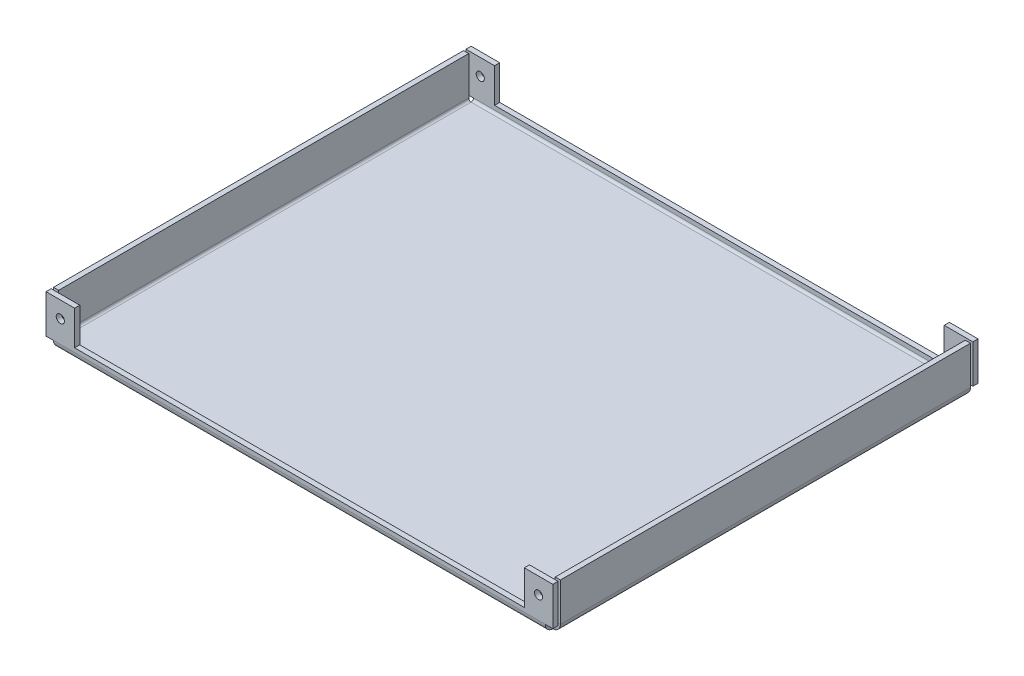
ISO-10303-21;
HEADER;
FILE_DESCRIPTION(('STEP AP214'),'2;1');
FILE_NAME('part.step','',(''),(''),'','','');
FILE_SCHEMA(('AUTOMOTIVE_DESIGN { 1 0 10303 214 1 1 1 1 }'));
ENDSEC;
DATA;
#1=APPLICATION_CONTEXT('core data for automotive mechanical design processes');
#2=APPLICATION_PROTOCOL_DEFINITION('international standard','automotive_design',2000,#1);
#3=PRODUCT_CONTEXT('',#1,'mechanical');
#4=PRODUCT('Part','Part','',(#3));
#5=PRODUCT_RELATED_PRODUCT_CATEGORY('part','',(#4));
#6=PRODUCT_DEFINITION_FORMATION('','',#4);
#7=PRODUCT_DEFINITION_CONTEXT('part definition',#1,'design');
#8=PRODUCT_DEFINITION('design','',#6,#7);
#9=PRODUCT_DEFINITION_SHAPE('','',#8);
#10=(LENGTH_UNIT() NAMED_UNIT(*) SI_UNIT(.MILLI.,.METRE.));
#11=(NAMED_UNIT(*) PLANE_ANGLE_UNIT() SI_UNIT($,.RADIAN.));
#12=(NAMED_UNIT(*) SI_UNIT($,.STERADIAN.) SOLID_ANGLE_UNIT());
#13=UNCERTAINTY_MEASURE_WITH_UNIT(LENGTH_MEASURE(1.E-05),#10,'distance_accuracy_value','');
#14=(GEOMETRIC_REPRESENTATION_CONTEXT(3) GLOBAL_UNCERTAINTY_ASSIGNED_CONTEXT((#13)) GLOBAL_UNIT_ASSIGNED_CONTEXT((#10,
#11,#12)) REPRESENTATION_CONTEXT('',''));
#15=CARTESIAN_POINT('',(0.,0.,0.));
#16=DIRECTION('',(0.,0.,1.));
#17=DIRECTION('',(1.,0.,0.));
#18=AXIS2_PLACEMENT_3D('',#15,#16,#17);
#19=CARTESIAN_POINT('',(76.4032,2.3368,64.4398));
#20=DIRECTION('',(0.,1.,0.));
#21=DIRECTION('',(0.,0.,1.));
#22=AXIS2_PLACEMENT_3D('',#19,#20,#21);
#23=PLANE('',#22);
#24=DIRECTION('',(0.,0.,1.));
#25=VECTOR('',#24,1.);
#26=CARTESIAN_POINT('',(76.4032,2.3368,64.4398));
#27=LINE('',#26,#25);
#28=CARTESIAN_POINT('',(76.4032,2.3368,64.4398));
#29=VERTEX_POINT('',#28);
#30=CARTESIAN_POINT('',(76.4032,2.3368,66.04));
#31=VERTEX_POINT('',#30);
#32=EDGE_CURVE('E13',#29,#31,#27,.T.);
#33=ORIENTED_EDGE('',*,*,#32,.F.);
#34=DIRECTION('',(1.,0.,0.));
#35=VECTOR('',#34,1.);
#36=CARTESIAN_POINT('',(-78.74,2.3368,64.4398));
#37=LINE('',#36,#35);
#38=CARTESIAN_POINT('',(78.74,2.3368,64.4398));
#39=VERTEX_POINT('',#38);
#40=EDGE_CURVE('E630',#29,#39,#37,.T.);
#41=ORIENTED_EDGE('',*,*,#40,.T.);
#42=DIRECTION('',(0.,0.,-1.));
#43=VECTOR('',#42,1.);
#44=CARTESIAN_POINT('',(78.74,2.3368,64.4398));
#45=LINE('',#44,#43);
#46=CARTESIAN_POINT('',(78.74,2.3368,66.04));
#47=VERTEX_POINT('',#46);
#48=EDGE_CURVE('E657',#39,#47,#45,.F.);
#49=ORIENTED_EDGE('',*,*,#48,.T.);
#50=DIRECTION('',(1.,0.,0.));
#51=VECTOR('',#50,1.);
#52=CARTESIAN_POINT('',(-78.74,2.3368,66.04));
#53=LINE('',#52,#51);
#54=EDGE_CURVE('E632',#47,#31,#53,.F.);
#55=ORIENTED_EDGE('',*,*,#54,.T.);
#56=EDGE_LOOP('',(#33,#41,#49,#55));
#57=FACE_BOUND('',#56,.T.);
#58=ADVANCED_FACE('F125',(#57),#23,.F.);
#59=CARTESIAN_POINT('',(78.74,2.3368,63.7032));
#60=DIRECTION('',(1.,0.,0.));
#61=DIRECTION('',(0.,0.,1.));
#62=AXIS2_PLACEMENT_3D('',#59,#60,#61);
#63=CYLINDRICAL_SURFACE('',#62,2.3368);
#64=DIRECTION('',(1.,0.,0.));
#65=VECTOR('',#64,1.);
#66=CARTESIAN_POINT('',(78.74,0.,63.7032));
#67=LINE('',#66,#65);
#68=CARTESIAN_POINT('',(76.4032,0.,63.7032));
#69=VERTEX_POINT('',#68);
#70=CARTESIAN_POINT('',(-76.4032,0.,63.7032));
#71=VERTEX_POINT('',#70);
#72=EDGE_CURVE('E663',#69,#71,#67,.F.);
#73=ORIENTED_EDGE('',*,*,#72,.F.);
#74=CARTESIAN_POINT('',(76.4032,2.3368,63.7032));
#75=DIRECTION('',(1.,0.,0.));
#76=DIRECTION('',(0.,0.,-1.));
#77=AXIS2_PLACEMENT_3D('',#74,#75,#76);
#78=CIRCLE('',#77,2.3368);
#79=EDGE_CURVE('E133',#69,#31,#78,.F.);
#80=ORIENTED_EDGE('',*,*,#79,.T.);
#81=CARTESIAN_POINT('',(-76.4032,2.3368,66.04));
#82=VERTEX_POINT('',#81);
#83=EDGE_CURVE('E689',#31,#82,#53,.F.);
#84=ORIENTED_EDGE('',*,*,#83,.T.);
#85=CARTESIAN_POINT('',(-76.4032,2.3368,63.7032));
#86=DIRECTION('',(-1.,0.,0.));
#87=DIRECTION('',(0.,0.,1.));
#88=AXIS2_PLACEMENT_3D('',#85,#86,#87);
#89=CIRCLE('',#88,2.3368);
#90=EDGE_CURVE('E675',#82,#71,#89,.F.);
#91=ORIENTED_EDGE('',*,*,#90,.T.);
#92=EDGE_LOOP('',(#73,#80,#84,#91));
#93=FACE_BOUND('',#92,.T.);
#94=ADVANCED_FACE('F619',(#93),#63,.T.);
#95=CARTESIAN_POINT('',(76.4032,2.3368,63.7032));
#96=DIRECTION('',(1.,0.,0.));
#97=DIRECTION('',(0.,0.,-1.));
#98=AXIS2_PLACEMENT_3D('',#95,#96,#97);
#99=PLANE('',#98);
#100=CARTESIAN_POINT('',(76.4032,2.3368,63.7032));
#101=DIRECTION('',(1.,0.,0.));
#102=DIRECTION('',(0.,0.,-1.));
#103=AXIS2_PLACEMENT_3D('',#100,#101,#102);
#104=CIRCLE('',#103,0.736600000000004);
#105=CARTESIAN_POINT('',(76.4032,1.6002,63.7032));
#106=VERTEX_POINT('',#105);
#107=EDGE_CURVE('E636',#106,#29,#104,.F.);
#108=ORIENTED_EDGE('',*,*,#107,.T.);
#109=ORIENTED_EDGE('',*,*,#32,.T.);
#110=ORIENTED_EDGE('',*,*,#79,.F.);
#111=DIRECTION('',(0.,-1.,0.));
#112=VECTOR('',#111,1.);
#113=CARTESIAN_POINT('',(76.4032,1.6002,63.7032));
#114=LINE('',#113,#112);
#115=EDGE_CURVE('E485',#106,#69,#114,.T.);
#116=ORIENTED_EDGE('',*,*,#115,.F.);
#117=EDGE_LOOP('',(#108,#109,#110,#116));
#118=FACE_BOUND('',#117,.T.);
#119=ADVANCED_FACE('F624',(#118),#99,.T.);
#120=CARTESIAN_POINT('',(76.4032,2.33680000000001,-66.04));
#121=DIRECTION('',(0.,-1.,0.));
#122=DIRECTION('',(0.,0.,-1.));
#123=AXIS2_PLACEMENT_3D('',#120,#121,#122);
#124=PLANE('',#123);
#125=DIRECTION('',(0.,0.,1.));
#126=VECTOR('',#125,1.);
#127=CARTESIAN_POINT('',(76.4032,2.33680000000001,-66.04));
#128=LINE('',#127,#126);
#129=CARTESIAN_POINT('',(76.4032,2.33680000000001,-66.04));
#130=VERTEX_POINT('',#129);
#131=CARTESIAN_POINT('',(76.4032,2.3368,-64.4398));
#132=VERTEX_POINT('',#131);
#133=EDGE_CURVE('E640',#130,#132,#128,.T.);
#134=ORIENTED_EDGE('',*,*,#133,.F.);
#135=DIRECTION('',(-1.,0.,0.));
#136=VECTOR('',#135,1.);
#137=CARTESIAN_POINT('',(78.74,2.33680000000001,-66.04));
#138=LINE('',#137,#136);
#139=CARTESIAN_POINT('',(78.74,2.33679999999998,-66.04));
#140=VERTEX_POINT('',#139);
#141=EDGE_CURVE('E414',#130,#140,#138,.F.);
#142=ORIENTED_EDGE('',*,*,#141,.T.);
#143=DIRECTION('',(0.,0.,1.));
#144=VECTOR('',#143,1.);
#145=CARTESIAN_POINT('',(78.74,2.33680000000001,-66.04));
#146=LINE('',#145,#144);
#147=CARTESIAN_POINT('',(78.74,2.33679999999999,-64.4398));
#148=VERTEX_POINT('',#147);
#149=EDGE_CURVE('E421',#148,#140,#146,.F.);
#150=ORIENTED_EDGE('',*,*,#149,.F.);
#151=DIRECTION('',(-1.,0.,0.));
#152=VECTOR('',#151,1.);
#153=CARTESIAN_POINT('',(78.74,2.3368,-64.4398));
#154=LINE('',#153,#152);
#155=EDGE_CURVE('E416',#148,#132,#154,.T.);
#156=ORIENTED_EDGE('',*,*,#155,.T.);
#157=EDGE_LOOP('',(#134,#142,#150,#156));
#158=FACE_BOUND('',#157,.T.);
#159=ADVANCED_FACE('F794',(#158),#124,.T.);
#160=CARTESIAN_POINT('',(-78.74,2.33679999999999,-63.7032));
#161=DIRECTION('',(-1.,0.,0.));
#162=DIRECTION('',(0.,0.,-1.));
#163=AXIS2_PLACEMENT_3D('',#160,#161,#162);
#164=CYLINDRICAL_SURFACE('',#163,2.33680000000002);
#165=CARTESIAN_POINT('',(-76.4032,2.33680000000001,-66.04));
#166=VERTEX_POINT('',#165);
#167=EDGE_CURVE('E413',#166,#130,#138,.F.);
#168=ORIENTED_EDGE('',*,*,#167,.T.);
#169=CARTESIAN_POINT('',(76.4032,2.33679999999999,-63.7032));
#170=DIRECTION('',(1.,0.,0.));
#171=DIRECTION('',(0.,0.,-1.));
#172=AXIS2_PLACEMENT_3D('',#169,#170,#171);
#173=CIRCLE('',#172,2.33680000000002);
#174=CARTESIAN_POINT('',(76.4032,0.,-63.7032));
#175=VERTEX_POINT('',#174);
#176=EDGE_CURVE('E681',#130,#175,#173,.F.);
#177=ORIENTED_EDGE('',*,*,#176,.T.);
#178=DIRECTION('',(-1.,0.,0.));
#179=VECTOR('',#178,1.);
#180=CARTESIAN_POINT('',(-78.74,0.,-63.7032));
#181=LINE('',#180,#179);
#182=CARTESIAN_POINT('',(-76.4032,0.,-63.7032));
#183=VERTEX_POINT('',#182);
#184=EDGE_CURVE('E425',#183,#175,#181,.F.);
#185=ORIENTED_EDGE('',*,*,#184,.F.);
#186=CARTESIAN_POINT('',(-76.4032,2.33679999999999,-63.7032));
#187=DIRECTION('',(-1.,0.,0.));
#188=DIRECTION('',(0.,0.,1.));
#189=AXIS2_PLACEMENT_3D('',#186,#187,#188);
#190=CIRCLE('',#189,2.33680000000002);
#191=EDGE_CURVE('E670',#183,#166,#190,.F.);
#192=ORIENTED_EDGE('',*,*,#191,.T.);
#193=EDGE_LOOP('',(#168,#177,#185,#192));
#194=FACE_BOUND('',#193,.T.);
#195=ADVANCED_FACE('F790',(#194),#164,.T.);
#196=CARTESIAN_POINT('',(78.74,1.6002,-66.04));
#197=DIRECTION('',(0.,1.,0.));
#198=DIRECTION('',(0.,0.,1.));
#199=AXIS2_PLACEMENT_3D('',#196,#197,#198);
#200=PLANE('',#199);
#201=DIRECTION('',(1.,0.,0.));
#202=VECTOR('',#201,1.);
#203=CARTESIAN_POINT('',(78.74,1.6002,63.7032));
#204=LINE('',#203,#202);
#205=CARTESIAN_POINT('',(-76.4032,1.6002,63.7032));
#206=VERTEX_POINT('',#205);
#207=EDGE_CURVE('E438',#106,#206,#204,.F.);
#208=ORIENTED_EDGE('',*,*,#207,.F.);
#209=DIRECTION('',(0.,0.,-1.));
#210=VECTOR('',#209,1.);
#211=CARTESIAN_POINT('',(76.4032,1.6002,-63.7032));
#212=LINE('',#211,#210);
#213=CARTESIAN_POINT('',(76.4032,1.6002,-63.7032));
#214=VERTEX_POINT('',#213);
#215=EDGE_CURVE('E520',#214,#106,#212,.F.);
#216=ORIENTED_EDGE('',*,*,#215,.F.);
#217=DIRECTION('',(-1.,0.,0.));
#218=VECTOR('',#217,1.);
#219=CARTESIAN_POINT('',(-78.74,1.60019999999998,-63.7032));
#220=LINE('',#219,#218);
#221=CARTESIAN_POINT('',(-76.4032,1.60019999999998,-63.7032));
#222=VERTEX_POINT('',#221);
#223=EDGE_CURVE('E428',#222,#214,#220,.F.);
#224=ORIENTED_EDGE('',*,*,#223,.F.);
#225=DIRECTION('',(0.,0.,1.));
#226=VECTOR('',#225,1.);
#227=CARTESIAN_POINT('',(-76.4032,1.6002,63.7032));
#228=LINE('',#227,#226);
#229=EDGE_CURVE('E466',#206,#222,#228,.F.);
#230=ORIENTED_EDGE('',*,*,#229,.F.);
#231=EDGE_LOOP('',(#208,#216,#224,#230));
#232=FACE_BOUND('',#231,.T.);
#233=ADVANCED_FACE('F793',(#232),#200,.T.);
#234=CARTESIAN_POINT('',(78.74,0.,-66.04));
#235=DIRECTION('',(0.,1.,0.));
#236=DIRECTION('',(0.,0.,1.));
#237=AXIS2_PLACEMENT_3D('',#234,#235,#236);
#238=PLANE('',#237);
#239=DIRECTION('',(0.,0.,-1.));
#240=VECTOR('',#239,1.);
#241=CARTESIAN_POINT('',(76.4032,0.,-63.7032));
#242=LINE('',#241,#240);
#243=EDGE_CURVE('E530',#175,#69,#242,.F.);
#244=ORIENTED_EDGE('',*,*,#243,.T.);
#245=ORIENTED_EDGE('',*,*,#72,.T.);
#246=DIRECTION('',(0.,0.,1.));
#247=VECTOR('',#246,1.);
#248=CARTESIAN_POINT('',(-76.4032,0.,63.7032));
#249=LINE('',#248,#247);
#250=EDGE_CURVE('E476',#71,#183,#249,.F.);
#251=ORIENTED_EDGE('',*,*,#250,.T.);
#252=ORIENTED_EDGE('',*,*,#184,.T.);
#253=EDGE_LOOP('',(#244,#245,#251,#252));
#254=FACE_BOUND('',#253,.T.);
#255=ADVANCED_FACE('F716',(#254),#238,.F.);
#256=CARTESIAN_POINT('',(-76.4032,2.3368,66.04));
#257=DIRECTION('',(0.,-1.,0.));
#258=DIRECTION('',(0.,0.,-1.));
#259=AXIS2_PLACEMENT_3D('',#256,#257,#258);
#260=PLANE('',#259);
#261=DIRECTION('',(0.,0.,-1.));
#262=VECTOR('',#261,1.);
#263=CARTESIAN_POINT('',(-76.4032,2.3368,66.04));
#264=LINE('',#263,#262);
#265=CARTESIAN_POINT('',(-76.4032,2.3368,64.4398));
#266=VERTEX_POINT('',#265);
#267=EDGE_CURVE('E679',#82,#266,#264,.T.);
#268=ORIENTED_EDGE('',*,*,#267,.F.);
#269=CARTESIAN_POINT('',(-78.74,2.3368,66.04));
#270=VERTEX_POINT('',#269);
#271=EDGE_CURVE('E693',#82,#270,#53,.F.);
#272=ORIENTED_EDGE('',*,*,#271,.T.);
#273=DIRECTION('',(0.,0.,-1.));
#274=VECTOR('',#273,1.);
#275=CARTESIAN_POINT('',(-78.74,2.3368,66.04));
#276=LINE('',#275,#274);
#277=CARTESIAN_POINT('',(-78.74,2.3368,64.4398));
#278=VERTEX_POINT('',#277);
#279=EDGE_CURVE('E427',#278,#270,#276,.F.);
#280=ORIENTED_EDGE('',*,*,#279,.F.);
#281=EDGE_CURVE('E652',#278,#266,#37,.T.);
#282=ORIENTED_EDGE('',*,*,#281,.T.);
#283=EDGE_LOOP('',(#268,#272,#280,#282));
#284=FACE_BOUND('',#283,.T.);
#285=ADVANCED_FACE('F709',(#284),#260,.T.);
#286=CARTESIAN_POINT('',(-76.4032,2.3368,-64.4398));
#287=DIRECTION('',(0.,1.,0.));
#288=DIRECTION('',(0.,0.,1.));
#289=AXIS2_PLACEMENT_3D('',#286,#287,#288);
#290=PLANE('',#289);
#291=DIRECTION('',(0.,0.,-1.));
#292=VECTOR('',#291,1.);
#293=CARTESIAN_POINT('',(-76.4032,2.3368,-64.4398));
#294=LINE('',#293,#292);
#295=CARTESIAN_POINT('',(-76.4032,2.3368,-64.4398));
#296=VERTEX_POINT('',#295);
#297=EDGE_CURVE('E673',#296,#166,#294,.T.);
#298=ORIENTED_EDGE('',*,*,#297,.F.);
#299=CARTESIAN_POINT('',(-78.74,2.33679999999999,-64.4398));
#300=VERTEX_POINT('',#299);
#301=EDGE_CURVE('E420',#296,#300,#154,.T.);
#302=ORIENTED_EDGE('',*,*,#301,.T.);
#303=DIRECTION('',(0.,0.,1.));
#304=VECTOR('',#303,1.);
#305=CARTESIAN_POINT('',(-78.74,2.3368,-64.4398));
#306=LINE('',#305,#304);
#307=CARTESIAN_POINT('',(-78.74,2.33680000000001,-66.04));
#308=VERTEX_POINT('',#307);
#309=EDGE_CURVE('E342',#300,#308,#306,.F.);
#310=ORIENTED_EDGE('',*,*,#309,.T.);
#311=EDGE_CURVE('E410',#308,#166,#138,.F.);
#312=ORIENTED_EDGE('',*,*,#311,.T.);
#313=EDGE_LOOP('',(#298,#302,#310,#312));
#314=FACE_BOUND('',#313,.T.);
#315=ADVANCED_FACE('F825',(#314),#290,.F.);
#316=CARTESIAN_POINT('',(76.4032,2.33679999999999,-63.7032));
#317=DIRECTION('',(1.,0.,0.));
#318=DIRECTION('',(0.,0.,-1.));
#319=AXIS2_PLACEMENT_3D('',#316,#317,#318);
#320=PLANE('',#319);
#321=ORIENTED_EDGE('',*,*,#176,.F.);
#322=ORIENTED_EDGE('',*,*,#133,.T.);
#323=CARTESIAN_POINT('',(76.4032,2.33679999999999,-63.7032));
#324=DIRECTION('',(1.,0.,0.));
#325=DIRECTION('',(0.,0.,-1.));
#326=AXIS2_PLACEMENT_3D('',#323,#324,#325);
#327=CIRCLE('',#326,0.736600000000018);
#328=EDGE_CURVE('E684',#132,#214,#327,.F.);
#329=ORIENTED_EDGE('',*,*,#328,.T.);
#330=DIRECTION('',(0.,-1.,0.));
#331=VECTOR('',#330,1.);
#332=CARTESIAN_POINT('',(76.4032,1.6002,-63.7032));
#333=LINE('',#332,#331);
#334=EDGE_CURVE('E511',#214,#175,#333,.T.);
#335=ORIENTED_EDGE('',*,*,#334,.T.);
#336=EDGE_LOOP('',(#321,#322,#329,#335));
#337=FACE_BOUND('',#336,.T.);
#338=ADVANCED_FACE('F823',(#337),#320,.T.);
#339=CARTESIAN_POINT('',(-76.4032,2.33679999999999,-63.7032));
#340=DIRECTION('',(-1.,0.,0.));
#341=DIRECTION('',(0.,0.,1.));
#342=AXIS2_PLACEMENT_3D('',#339,#340,#341);
#343=PLANE('',#342);
#344=CARTESIAN_POINT('',(-76.4032,2.33679999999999,-63.7032));
#345=DIRECTION('',(-1.,0.,0.));
#346=DIRECTION('',(0.,0.,1.));
#347=AXIS2_PLACEMENT_3D('',#344,#345,#346);
#348=CIRCLE('',#347,0.736600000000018);
#349=EDGE_CURVE('E666',#222,#296,#348,.F.);
#350=ORIENTED_EDGE('',*,*,#349,.T.);
#351=ORIENTED_EDGE('',*,*,#297,.T.);
#352=ORIENTED_EDGE('',*,*,#191,.F.);
#353=DIRECTION('',(0.,-1.,0.));
#354=VECTOR('',#353,1.);
#355=CARTESIAN_POINT('',(-76.4032,1.6002,-63.7032));
#356=LINE('',#355,#354);
#357=EDGE_CURVE('E424',#222,#183,#356,.T.);
#358=ORIENTED_EDGE('',*,*,#357,.F.);
#359=EDGE_LOOP('',(#350,#351,#352,#358));
#360=FACE_BOUND('',#359,.T.);
#361=ADVANCED_FACE('F820',(#360),#343,.T.);
#362=CARTESIAN_POINT('',(-76.4032,2.3368,63.7032));
#363=DIRECTION('',(-1.,0.,0.));
#364=DIRECTION('',(0.,0.,1.));
#365=AXIS2_PLACEMENT_3D('',#362,#363,#364);
#366=PLANE('',#365);
#367=ORIENTED_EDGE('',*,*,#90,.F.);
#368=ORIENTED_EDGE('',*,*,#267,.T.);
#369=CARTESIAN_POINT('',(-76.4032,2.3368,63.7032));
#370=DIRECTION('',(-1.,0.,0.));
#371=DIRECTION('',(0.,0.,1.));
#372=AXIS2_PLACEMENT_3D('',#369,#370,#371);
#373=CIRCLE('',#372,0.736600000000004);
#374=EDGE_CURVE('E656',#266,#206,#373,.F.);
#375=ORIENTED_EDGE('',*,*,#374,.T.);
#376=DIRECTION('',(0.,-1.,0.));
#377=VECTOR('',#376,1.);
#378=CARTESIAN_POINT('',(-76.4032,1.6002,63.7032));
#379=LINE('',#378,#377);
#380=EDGE_CURVE('E458',#206,#71,#379,.T.);
#381=ORIENTED_EDGE('',*,*,#380,.T.);
#382=EDGE_LOOP('',(#367,#368,#375,#381));
#383=FACE_BOUND('',#382,.T.);
#384=ADVANCED_FACE('F712',(#383),#366,.T.);
#385=CARTESIAN_POINT('',(78.74,2.3368,63.7032));
#386=DIRECTION('',(1.,0.,0.));
#387=DIRECTION('',(0.,0.,1.));
#388=AXIS2_PLACEMENT_3D('',#385,#386,#387);
#389=CYLINDRICAL_SURFACE('',#388,0.736600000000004);
#390=ORIENTED_EDGE('',*,*,#107,.F.);
#391=ORIENTED_EDGE('',*,*,#207,.T.);
#392=ORIENTED_EDGE('',*,*,#374,.F.);
#393=EDGE_CURVE('E647',#266,#29,#37,.T.);
#394=ORIENTED_EDGE('',*,*,#393,.T.);
#395=EDGE_LOOP('',(#390,#391,#392,#394));
#396=FACE_BOUND('',#395,.T.);
#397=ADVANCED_FACE('F654',(#396),#389,.F.);
#398=CARTESIAN_POINT('',(-78.74,1.6002,66.04));
#399=DIRECTION('',(1.,0.,0.));
#400=DIRECTION('',(0.,0.,-1.));
#401=AXIS2_PLACEMENT_3D('',#398,#399,#400);
#402=PLANE('',#401);
#403=ORIENTED_EDGE('',*,*,#279,.T.);
#404=DIRECTION('',(0.,-1.,0.));
#405=VECTOR('',#404,1.);
#406=CARTESIAN_POINT('',(-78.74,3.6322,66.04));
#407=LINE('',#406,#405);
#408=CARTESIAN_POINT('',(-78.74,14.3002,66.04));
#409=VERTEX_POINT('',#408);
#410=EDGE_CURVE('E699',#409,#270,#407,.T.);
#411=ORIENTED_EDGE('',*,*,#410,.F.);
#412=DIRECTION('',(0.,0.,1.));
#413=VECTOR('',#412,1.);
#414=CARTESIAN_POINT('',(-78.74,14.3002,64.4398));
#415=LINE('',#414,#413);
#416=CARTESIAN_POINT('',(-78.74,14.3002,64.4398));
#417=VERTEX_POINT('',#416);
#418=EDGE_CURVE('E539',#417,#409,#415,.T.);
#419=ORIENTED_EDGE('',*,*,#418,.F.);
#420=DIRECTION('',(0.,1.,0.));
#421=VECTOR('',#420,1.);
#422=CARTESIAN_POINT('',(-78.74,1.6002,64.4398));
#423=LINE('',#422,#421);
#424=EDGE_CURVE('E694',#417,#278,#423,.F.);
#425=ORIENTED_EDGE('',*,*,#424,.T.);
#426=EDGE_LOOP('',(#403,#411,#419,#425));
#427=FACE_BOUND('',#426,.T.);
#428=ADVANCED_FACE('F707',(#427),#402,.F.);
#429=CARTESIAN_POINT('',(78.74,3.6322,66.04));
#430=DIRECTION('',(-1.,0.,0.));
#431=DIRECTION('',(0.,0.,1.));
#432=AXIS2_PLACEMENT_3D('',#429,#430,#431);
#433=PLANE('',#432);
#434=ORIENTED_EDGE('',*,*,#48,.F.);
#435=DIRECTION('',(0.,-1.,0.));
#436=VECTOR('',#435,1.);
#437=CARTESIAN_POINT('',(78.74,3.6322,64.4398));
#438=LINE('',#437,#436);
#439=CARTESIAN_POINT('',(78.74,14.3002,64.4398));
#440=VERTEX_POINT('',#439);
#441=EDGE_CURVE('E650',#39,#440,#438,.F.);
#442=ORIENTED_EDGE('',*,*,#441,.T.);
#443=DIRECTION('',(0.,0.,1.));
#444=VECTOR('',#443,1.);
#445=CARTESIAN_POINT('',(78.74,14.3002,64.4398));
#446=LINE('',#445,#444);
#447=CARTESIAN_POINT('',(78.74,14.3002,66.04));
#448=VERTEX_POINT('',#447);
#449=EDGE_CURVE('E1419',#440,#448,#446,.T.);
#450=ORIENTED_EDGE('',*,*,#449,.T.);
#451=DIRECTION('',(0.,1.,0.));
#452=VECTOR('',#451,1.);
#453=CARTESIAN_POINT('',(78.74,3.6322,66.04));
#454=LINE('',#453,#452);
#455=EDGE_CURVE('E433',#47,#448,#454,.T.);
#456=ORIENTED_EDGE('',*,*,#455,.F.);
#457=EDGE_LOOP('',(#434,#442,#450,#456));
#458=FACE_BOUND('',#457,.T.);
#459=ADVANCED_FACE('F801',(#458),#433,.F.);
#460=CARTESIAN_POINT('',(-78.74,3.6322,66.04));
#461=DIRECTION('',(0.,0.,-1.));
#462=DIRECTION('',(-1.,0.,0.));
#463=AXIS2_PLACEMENT_3D('',#460,#461,#462);
#464=PLANE('',#463);
#465=CARTESIAN_POINT('',(-74.295,9.22019999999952,66.04));
#466=DIRECTION('',(0.,0.,-1.));
#467=DIRECTION('',(-1.,0.,0.));
#468=AXIS2_PLACEMENT_3D('',#465,#466,#467);
#469=CIRCLE('',#468,1.26999999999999);
#470=CARTESIAN_POINT('',(-75.565,9.22019999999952,66.04));
#471=VERTEX_POINT('',#470);
#472=EDGE_CURVE('E1248',#471,#471,#469,.T.);
#473=ORIENTED_EDGE('',*,*,#472,.T.);
#474=EDGE_LOOP('',(#473));
#475=FACE_BOUND('',#474,.T.);
#476=CARTESIAN_POINT('',(74.2950000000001,9.22019999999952,66.04));
#477=DIRECTION('',(0.,0.,-1.));
#478=DIRECTION('',(-1.,0.,0.));
#479=AXIS2_PLACEMENT_3D('',#476,#477,#478);
#480=CIRCLE('',#479,1.26999999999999);
#481=CARTESIAN_POINT('',(73.0250000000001,9.22019999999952,66.04));
#482=VERTEX_POINT('',#481);
#483=EDGE_CURVE('E364',#482,#482,#480,.T.);
#484=ORIENTED_EDGE('',*,*,#483,.T.);
#485=EDGE_LOOP('',(#484));
#486=FACE_BOUND('',#485,.T.);
#487=ORIENTED_EDGE('',*,*,#54,.F.);
#488=ORIENTED_EDGE('',*,*,#455,.T.);
#489=DIRECTION('',(-1.,0.,0.));
#490=VECTOR('',#489,1.);
#491=CARTESIAN_POINT('',(78.74,14.3002,66.04));
#492=LINE('',#491,#490);
#493=CARTESIAN_POINT('',(69.85,14.3002,66.04));
#494=VERTEX_POINT('',#493);
#495=EDGE_CURVE('E383',#448,#494,#492,.T.);
#496=ORIENTED_EDGE('',*,*,#495,.T.);
#497=DIRECTION('',(0.,-1.,0.));
#498=VECTOR('',#497,1.);
#499=CARTESIAN_POINT('',(69.85,3.6322,66.04));
#500=LINE('',#499,#498);
#501=CARTESIAN_POINT('',(69.8500000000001,3.6322,66.04));
#502=VERTEX_POINT('',#501);
#503=EDGE_CURVE('E1422',#494,#502,#500,.T.);
#504=ORIENTED_EDGE('',*,*,#503,.T.);
#505=DIRECTION('',(-1.,0.,0.));
#506=VECTOR('',#505,1.);
#507=CARTESIAN_POINT('',(-78.74,3.6322,66.04));
#508=LINE('',#507,#506);
#509=CARTESIAN_POINT('',(-69.85,3.6322,66.04));
#510=VERTEX_POINT('',#509);
#511=EDGE_CURVE('E436',#502,#510,#508,.T.);
#512=ORIENTED_EDGE('',*,*,#511,.T.);
#513=DIRECTION('',(0.,1.,0.));
#514=VECTOR('',#513,1.);
#515=CARTESIAN_POINT('',(-69.85,3.6322,66.04));
#516=LINE('',#515,#514);
#517=CARTESIAN_POINT('',(-69.85,14.3002,66.04));
#518=VERTEX_POINT('',#517);
#519=EDGE_CURVE('E588',#510,#518,#516,.T.);
#520=ORIENTED_EDGE('',*,*,#519,.T.);
#521=DIRECTION('',(-1.,0.,0.));
#522=VECTOR('',#521,1.);
#523=CARTESIAN_POINT('',(-78.74,14.3002,66.04));
#524=LINE('',#523,#522);
#525=EDGE_CURVE('E579',#518,#409,#524,.T.);
#526=ORIENTED_EDGE('',*,*,#525,.T.);
#527=ORIENTED_EDGE('',*,*,#410,.T.);
#528=ORIENTED_EDGE('',*,*,#271,.F.);
#529=ORIENTED_EDGE('',*,*,#83,.F.);
#530=EDGE_LOOP('',(#487,#488,#496,#504,#512,#520,#526,#527,#528,#529));
#531=FACE_BOUND('',#530,.T.);
#532=ADVANCED_FACE('F602',(#475,#486,#531),#464,.F.);
#533=CARTESIAN_POINT('',(-78.74,3.6322,64.4398));
#534=DIRECTION('',(0.,0.,-1.));
#535=DIRECTION('',(-1.,0.,0.));
#536=AXIS2_PLACEMENT_3D('',#533,#534,#535);
#537=PLANE('',#536);
#538=CARTESIAN_POINT('',(-74.295,9.22019999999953,64.4398));
#539=DIRECTION('',(0.,0.,-1.));
#540=DIRECTION('',(-1.,0.,0.));
#541=AXIS2_PLACEMENT_3D('',#538,#539,#540);
#542=CIRCLE('',#541,1.26999999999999);
#543=CARTESIAN_POINT('',(-75.565,9.22019999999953,64.4398));
#544=VERTEX_POINT('',#543);
#545=EDGE_CURVE('E1245',#544,#544,#542,.T.);
#546=ORIENTED_EDGE('',*,*,#545,.F.);
#547=EDGE_LOOP('',(#546));
#548=FACE_BOUND('',#547,.T.);
#549=CARTESIAN_POINT('',(74.2950000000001,9.22019999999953,64.4398));
#550=DIRECTION('',(0.,0.,-1.));
#551=DIRECTION('',(-1.,0.,0.));
#552=AXIS2_PLACEMENT_3D('',#549,#550,#551);
#553=CIRCLE('',#552,1.26999999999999);
#554=CARTESIAN_POINT('',(73.0250000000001,9.22019999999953,64.4398));
#555=VERTEX_POINT('',#554);
#556=EDGE_CURVE('E1258',#555,#555,#553,.T.);
#557=ORIENTED_EDGE('',*,*,#556,.F.);
#558=EDGE_LOOP('',(#557));
#559=FACE_BOUND('',#558,.T.);
#560=ORIENTED_EDGE('',*,*,#441,.F.);
#561=ORIENTED_EDGE('',*,*,#40,.F.);
#562=ORIENTED_EDGE('',*,*,#393,.F.);
#563=ORIENTED_EDGE('',*,*,#281,.F.);
#564=ORIENTED_EDGE('',*,*,#424,.F.);
#565=DIRECTION('',(-1.,0.,0.));
#566=VECTOR('',#565,1.);
#567=CARTESIAN_POINT('',(-78.74,14.3002,64.4398));
#568=LINE('',#567,#566);
#569=CARTESIAN_POINT('',(-69.85,14.3002,64.4398));
#570=VERTEX_POINT('',#569);
#571=EDGE_CURVE('E574',#570,#417,#568,.T.);
#572=ORIENTED_EDGE('',*,*,#571,.F.);
#573=DIRECTION('',(0.,1.,0.));
#574=VECTOR('',#573,1.);
#575=CARTESIAN_POINT('',(-69.85,3.6322,64.4398));
#576=LINE('',#575,#574);
#577=CARTESIAN_POINT('',(-69.85,3.6322,64.4398));
#578=VERTEX_POINT('',#577);
#579=EDGE_CURVE('E577',#578,#570,#576,.T.);
#580=ORIENTED_EDGE('',*,*,#579,.F.);
#581=DIRECTION('',(1.,0.,0.));
#582=VECTOR('',#581,1.);
#583=CARTESIAN_POINT('',(-78.74,3.6322,64.4398));
#584=LINE('',#583,#582);
#585=CARTESIAN_POINT('',(69.85,3.6322,64.4398));
#586=VERTEX_POINT('',#585);
#587=EDGE_CURVE('E439',#586,#578,#584,.F.);
#588=ORIENTED_EDGE('',*,*,#587,.F.);
#589=DIRECTION('',(0.,-1.,0.));
#590=VECTOR('',#589,1.);
#591=CARTESIAN_POINT('',(69.85,3.6322,64.4398));
#592=LINE('',#591,#590);
#593=CARTESIAN_POINT('',(69.85,14.3002,64.4398));
#594=VERTEX_POINT('',#593);
#595=EDGE_CURVE('E1425',#594,#586,#592,.T.);
#596=ORIENTED_EDGE('',*,*,#595,.F.);
#597=DIRECTION('',(-1.,0.,0.));
#598=VECTOR('',#597,1.);
#599=CARTESIAN_POINT('',(78.74,14.3002,64.4398));
#600=LINE('',#599,#598);
#601=EDGE_CURVE('E388',#440,#594,#600,.T.);
#602=ORIENTED_EDGE('',*,*,#601,.F.);
#603=EDGE_LOOP('',(#560,#561,#562,#563,#564,#572,#580,#588,#596,#602));
#604=FACE_BOUND('',#603,.T.);
#605=ADVANCED_FACE('F645',(#548,#559,#604),#537,.T.);
#606=CARTESIAN_POINT('',(-78.74,3.6322,66.04));
#607=DIRECTION('',(0.,-1.,0.));
#608=DIRECTION('',(0.,0.,-1.));
#609=AXIS2_PLACEMENT_3D('',#606,#607,#608);
#610=PLANE('',#609);
#611=ORIENTED_EDGE('',*,*,#511,.F.);
#612=DIRECTION('',(0.,0.,1.));
#613=VECTOR('',#612,1.);
#614=CARTESIAN_POINT('',(69.85,3.6322,64.4398));
#615=LINE('',#614,#613);
#616=EDGE_CURVE('E594',#586,#502,#615,.T.);
#617=ORIENTED_EDGE('',*,*,#616,.F.);
#618=ORIENTED_EDGE('',*,*,#587,.T.);
#619=DIRECTION('',(0.,0.,1.));
#620=VECTOR('',#619,1.);
#621=CARTESIAN_POINT('',(-69.85,3.6322,64.4398));
#622=LINE('',#621,#620);
#623=EDGE_CURVE('E570',#578,#510,#622,.T.);
#624=ORIENTED_EDGE('',*,*,#623,.T.);
#625=EDGE_LOOP('',(#611,#617,#618,#624));
#626=FACE_BOUND('',#625,.T.);
#627=ADVANCED_FACE('F703',(#626),#610,.F.);
#628=CARTESIAN_POINT('',(-78.74,2.33679999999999,-63.7032));
#629=DIRECTION('',(-1.,0.,0.));
#630=DIRECTION('',(0.,0.,-1.));
#631=AXIS2_PLACEMENT_3D('',#628,#629,#630);
#632=CYLINDRICAL_SURFACE('',#631,0.736600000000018);
#633=ORIENTED_EDGE('',*,*,#328,.F.);
#634=EDGE_CURVE('E419',#132,#296,#154,.T.);
#635=ORIENTED_EDGE('',*,*,#634,.T.);
#636=ORIENTED_EDGE('',*,*,#349,.F.);
#637=ORIENTED_EDGE('',*,*,#223,.T.);
#638=EDGE_LOOP('',(#633,#635,#636,#637));
#639=FACE_BOUND('',#638,.T.);
#640=ADVANCED_FACE('F789',(#639),#632,.F.);
#641=CARTESIAN_POINT('',(78.74,1.60019999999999,-66.04));
#642=DIRECTION('',(-1.,0.,0.));
#643=DIRECTION('',(0.,0.,1.));
#644=AXIS2_PLACEMENT_3D('',#641,#642,#643);
#645=PLANE('',#644);
#646=ORIENTED_EDGE('',*,*,#149,.T.);
#647=DIRECTION('',(0.,-1.,0.));
#648=VECTOR('',#647,1.);
#649=CARTESIAN_POINT('',(78.74,3.63219999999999,-66.04));
#650=LINE('',#649,#648);
#651=CARTESIAN_POINT('',(78.74,14.3002,-66.0400000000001));
#652=VERTEX_POINT('',#651);
#653=EDGE_CURVE('E402',#652,#140,#650,.T.);
#654=ORIENTED_EDGE('',*,*,#653,.F.);
#655=DIRECTION('',(0.,0.,-1.));
#656=VECTOR('',#655,1.);
#657=CARTESIAN_POINT('',(78.74,14.3002,-64.4398000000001));
#658=LINE('',#657,#656);
#659=CARTESIAN_POINT('',(78.74,14.3002,-64.4398000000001));
#660=VERTEX_POINT('',#659);
#661=EDGE_CURVE('E380',#660,#652,#658,.T.);
#662=ORIENTED_EDGE('',*,*,#661,.F.);
#663=DIRECTION('',(0.,1.,0.));
#664=VECTOR('',#663,1.);
#665=CARTESIAN_POINT('',(78.74,1.60020000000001,-64.4398));
#666=LINE('',#665,#664);
#667=EDGE_CURVE('E347',#660,#148,#666,.F.);
#668=ORIENTED_EDGE('',*,*,#667,.T.);
#669=EDGE_LOOP('',(#646,#654,#662,#668));
#670=FACE_BOUND('',#669,.T.);
#671=ADVANCED_FACE('F453',(#670),#645,.F.);
#672=CARTESIAN_POINT('',(-78.74,3.63219999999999,-66.04));
#673=DIRECTION('',(1.,0.,0.));
#674=DIRECTION('',(0.,0.,-1.));
#675=AXIS2_PLACEMENT_3D('',#672,#673,#674);
#676=PLANE('',#675);
#677=ORIENTED_EDGE('',*,*,#309,.F.);
#678=DIRECTION('',(0.,-1.,0.));
#679=VECTOR('',#678,1.);
#680=CARTESIAN_POINT('',(-78.74,3.6322,-64.4398));
#681=LINE('',#680,#679);
#682=CARTESIAN_POINT('',(-78.74,14.3002,-64.4398000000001));
#683=VERTEX_POINT('',#682);
#684=EDGE_CURVE('E336',#300,#683,#681,.F.);
#685=ORIENTED_EDGE('',*,*,#684,.T.);
#686=DIRECTION('',(0.,0.,-1.));
#687=VECTOR('',#686,1.);
#688=CARTESIAN_POINT('',(-78.74,14.3002,-64.4398000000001));
#689=LINE('',#688,#687);
#690=CARTESIAN_POINT('',(-78.74,14.3002,-66.0400000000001));
#691=VERTEX_POINT('',#690);
#692=EDGE_CURVE('E340',#683,#691,#689,.T.);
#693=ORIENTED_EDGE('',*,*,#692,.T.);
#694=DIRECTION('',(0.,1.,0.));
#695=VECTOR('',#694,1.);
#696=CARTESIAN_POINT('',(-78.74,3.63219999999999,-66.04));
#697=LINE('',#696,#695);
#698=EDGE_CURVE('E455',#308,#691,#697,.T.);
#699=ORIENTED_EDGE('',*,*,#698,.F.);
#700=EDGE_LOOP('',(#677,#685,#693,#699));
#701=FACE_BOUND('',#700,.T.);
#702=ADVANCED_FACE('F338',(#701),#676,.F.);
#703=CARTESIAN_POINT('',(78.74,3.63219999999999,-66.04));
#704=DIRECTION('',(0.,0.,1.));
#705=DIRECTION('',(0.,-1.,0.));
#706=AXIS2_PLACEMENT_3D('',#703,#704,#705);
#707=PLANE('',#706);
#708=CARTESIAN_POINT('',(-74.295,9.22019999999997,-66.04));
#709=DIRECTION('',(0.,0.,1.));
#710=DIRECTION('',(0.,-1.,0.));
#711=AXIS2_PLACEMENT_3D('',#708,#709,#710);
#712=CIRCLE('',#711,1.26999999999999);
#713=CARTESIAN_POINT('',(-74.295,7.95019999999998,-66.04));
#714=VERTEX_POINT('',#713);
#715=EDGE_CURVE('E1253',#714,#714,#712,.T.);
#716=ORIENTED_EDGE('',*,*,#715,.T.);
#717=EDGE_LOOP('',(#716));
#718=FACE_BOUND('',#717,.T.);
#719=CARTESIAN_POINT('',(74.2950000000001,9.22019999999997,-66.04));
#720=DIRECTION('',(0.,0.,1.));
#721=DIRECTION('',(0.,-1.,0.));
#722=AXIS2_PLACEMENT_3D('',#719,#720,#721);
#723=CIRCLE('',#722,1.26999999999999);
#724=CARTESIAN_POINT('',(74.2950000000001,7.95019999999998,-66.04));
#725=VERTEX_POINT('',#724);
#726=EDGE_CURVE('E1252',#725,#725,#723,.T.);
#727=ORIENTED_EDGE('',*,*,#726,.T.);
#728=EDGE_LOOP('',(#727));
#729=FACE_BOUND('',#728,.T.);
#730=ORIENTED_EDGE('',*,*,#311,.F.);
#731=ORIENTED_EDGE('',*,*,#698,.T.);
#732=DIRECTION('',(1.,0.,0.));
#733=VECTOR('',#732,1.);
#734=CARTESIAN_POINT('',(-78.74,14.3002,-66.0400000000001));
#735=LINE('',#734,#733);
#736=CARTESIAN_POINT('',(-69.85,14.3002,-66.0400000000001));
#737=VERTEX_POINT('',#736);
#738=EDGE_CURVE('E353',#691,#737,#735,.T.);
#739=ORIENTED_EDGE('',*,*,#738,.T.);
#740=DIRECTION('',(0.,-1.,0.));
#741=VECTOR('',#740,1.);
#742=CARTESIAN_POINT('',(-69.85,3.63219999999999,-66.04));
#743=LINE('',#742,#741);
#744=CARTESIAN_POINT('',(-69.85,3.63219999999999,-66.04));
#745=VERTEX_POINT('',#744);
#746=EDGE_CURVE('E141',#737,#745,#743,.T.);
#747=ORIENTED_EDGE('',*,*,#746,.T.);
#748=DIRECTION('',(1.,0.,0.));
#749=VECTOR('',#748,1.);
#750=CARTESIAN_POINT('',(78.74,3.63219999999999,-66.04));
#751=LINE('',#750,#749);
#752=CARTESIAN_POINT('',(69.8500000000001,3.63219999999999,-66.04));
#753=VERTEX_POINT('',#752);
#754=EDGE_CURVE('E146',#745,#753,#751,.T.);
#755=ORIENTED_EDGE('',*,*,#754,.T.);
#756=DIRECTION('',(0.,1.,0.));
#757=VECTOR('',#756,1.);
#758=CARTESIAN_POINT('',(69.8500000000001,3.63219999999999,-66.04));
#759=LINE('',#758,#757);
#760=CARTESIAN_POINT('',(69.8500000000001,14.3002,-66.0400000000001));
#761=VERTEX_POINT('',#760);
#762=EDGE_CURVE('E370',#753,#761,#759,.T.);
#763=ORIENTED_EDGE('',*,*,#762,.T.);
#764=DIRECTION('',(1.,0.,0.));
#765=VECTOR('',#764,1.);
#766=CARTESIAN_POINT('',(78.74,14.3002,-66.0400000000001));
#767=LINE('',#766,#765);
#768=EDGE_CURVE('E377',#761,#652,#767,.T.);
#769=ORIENTED_EDGE('',*,*,#768,.T.);
#770=ORIENTED_EDGE('',*,*,#653,.T.);
#771=ORIENTED_EDGE('',*,*,#141,.F.);
#772=ORIENTED_EDGE('',*,*,#167,.F.);
#773=EDGE_LOOP('',(#730,#731,#739,#747,#755,#763,#769,#770,#771,#772));
#774=FACE_BOUND('',#773,.T.);
#775=ADVANCED_FACE('F444',(#718,#729,#774),#707,.F.);
#776=CARTESIAN_POINT('',(78.74,3.6322,-64.4398));
#777=DIRECTION('',(0.,0.,1.));
#778=DIRECTION('',(0.,-1.,0.));
#779=AXIS2_PLACEMENT_3D('',#776,#777,#778);
#780=PLANE('',#779);
#781=CARTESIAN_POINT('',(-74.295,9.22019999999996,-64.4398));
#782=DIRECTION('',(0.,0.,1.));
#783=DIRECTION('',(0.,-1.,0.));
#784=AXIS2_PLACEMENT_3D('',#781,#782,#783);
#785=CIRCLE('',#784,1.26999999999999);
#786=CARTESIAN_POINT('',(-74.295,7.95019999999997,-64.4398));
#787=VERTEX_POINT('',#786);
#788=EDGE_CURVE('E128',#787,#787,#785,.T.);
#789=ORIENTED_EDGE('',*,*,#788,.F.);
#790=EDGE_LOOP('',(#789));
#791=FACE_BOUND('',#790,.T.);
#792=CARTESIAN_POINT('',(74.2950000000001,9.22019999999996,-64.4398));
#793=DIRECTION('',(0.,0.,1.));
#794=DIRECTION('',(0.,-1.,0.));
#795=AXIS2_PLACEMENT_3D('',#792,#793,#794);
#796=CIRCLE('',#795,1.26999999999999);
#797=CARTESIAN_POINT('',(74.2950000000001,7.95019999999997,-64.4398));
#798=VERTEX_POINT('',#797);
#799=EDGE_CURVE('E1249',#798,#798,#796,.T.);
#800=ORIENTED_EDGE('',*,*,#799,.F.);
#801=EDGE_LOOP('',(#800));
#802=FACE_BOUND('',#801,.T.);
#803=ORIENTED_EDGE('',*,*,#684,.F.);
#804=ORIENTED_EDGE('',*,*,#301,.F.);
#805=ORIENTED_EDGE('',*,*,#634,.F.);
#806=ORIENTED_EDGE('',*,*,#155,.F.);
#807=ORIENTED_EDGE('',*,*,#667,.F.);
#808=DIRECTION('',(1.,0.,0.));
#809=VECTOR('',#808,1.);
#810=CARTESIAN_POINT('',(78.74,14.3002,-64.4398000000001));
#811=LINE('',#810,#809);
#812=CARTESIAN_POINT('',(69.8500000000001,14.3002,-64.4398000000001));
#813=VERTEX_POINT('',#812);
#814=EDGE_CURVE('E372',#813,#660,#811,.T.);
#815=ORIENTED_EDGE('',*,*,#814,.F.);
#816=DIRECTION('',(0.,1.,0.));
#817=VECTOR('',#816,1.);
#818=CARTESIAN_POINT('',(69.8500000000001,3.6322,-64.4398));
#819=LINE('',#818,#817);
#820=CARTESIAN_POINT('',(69.8500000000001,3.6322,-64.4398));
#821=VERTEX_POINT('',#820);
#822=EDGE_CURVE('E376',#821,#813,#819,.T.);
#823=ORIENTED_EDGE('',*,*,#822,.F.);
#824=DIRECTION('',(-1.,0.,0.));
#825=VECTOR('',#824,1.);
#826=CARTESIAN_POINT('',(78.74,3.6322,-64.4398));
#827=LINE('',#826,#825);
#828=CARTESIAN_POINT('',(-69.85,3.6322,-64.4398));
#829=VERTEX_POINT('',#828);
#830=EDGE_CURVE('E346',#829,#821,#827,.F.);
#831=ORIENTED_EDGE('',*,*,#830,.F.);
#832=DIRECTION('',(0.,-1.,0.));
#833=VECTOR('',#832,1.);
#834=CARTESIAN_POINT('',(-69.85,3.6322,-64.4398));
#835=LINE('',#834,#833);
#836=CARTESIAN_POINT('',(-69.85,14.3002,-64.4398000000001));
#837=VERTEX_POINT('',#836);
#838=EDGE_CURVE('E355',#837,#829,#835,.T.);
#839=ORIENTED_EDGE('',*,*,#838,.F.);
#840=DIRECTION('',(1.,0.,0.));
#841=VECTOR('',#840,1.);
#842=CARTESIAN_POINT('',(-78.74,14.3002,-64.4398000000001));
#843=LINE('',#842,#841);
#844=EDGE_CURVE('E352',#683,#837,#843,.T.);
#845=ORIENTED_EDGE('',*,*,#844,.F.);
#846=EDGE_LOOP('',(#803,#804,#805,#806,#807,#815,#823,#831,#839,#845));
#847=FACE_BOUND('',#846,.T.);
#848=ADVANCED_FACE('F358',(#791,#802,#847),#780,.T.);
#849=CARTESIAN_POINT('',(78.74,3.63219999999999,-66.04));
#850=DIRECTION('',(0.,-1.,0.));
#851=DIRECTION('',(0.,0.,-1.));
#852=AXIS2_PLACEMENT_3D('',#849,#850,#851);
#853=PLANE('',#852);
#854=ORIENTED_EDGE('',*,*,#754,.F.);
#855=DIRECTION('',(0.,0.,-1.));
#856=VECTOR('',#855,1.);
#857=CARTESIAN_POINT('',(-69.85,3.6322,-64.4398));
#858=LINE('',#857,#856);
#859=EDGE_CURVE('E368',#829,#745,#858,.T.);
#860=ORIENTED_EDGE('',*,*,#859,.F.);
#861=ORIENTED_EDGE('',*,*,#830,.T.);
#862=DIRECTION('',(0.,0.,-1.));
#863=VECTOR('',#862,1.);
#864=CARTESIAN_POINT('',(69.8500000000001,3.6322,-64.4398));
#865=LINE('',#864,#863);
#866=EDGE_CURVE('E375',#821,#753,#865,.T.);
#867=ORIENTED_EDGE('',*,*,#866,.T.);
#868=EDGE_LOOP('',(#854,#860,#861,#867));
#869=FACE_BOUND('',#868,.T.);
#870=ADVANCED_FACE('F773',(#869),#853,.F.);
#871=CARTESIAN_POINT('',(-76.4032,2.3368,-63.7032));
#872=DIRECTION('',(0.,0.,-1.));
#873=DIRECTION('',(-1.,0.,0.));
#874=AXIS2_PLACEMENT_3D('',#871,#872,#873);
#875=PLANE('',#874);
#876=DIRECTION('',(1.,0.,0.));
#877=VECTOR('',#876,1.);
#878=CARTESIAN_POINT('',(-78.74,2.33679999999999,-63.7032));
#879=LINE('',#878,#877);
#880=CARTESIAN_POINT('',(-77.1398,2.3368,-63.7032));
#881=VERTEX_POINT('',#880);
#882=CARTESIAN_POINT('',(-78.74,2.33679999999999,-63.7032));
#883=VERTEX_POINT('',#882);
#884=EDGE_CURVE('E481',#881,#883,#879,.F.);
#885=ORIENTED_EDGE('',*,*,#884,.F.);
#886=CARTESIAN_POINT('',(-76.4032,2.3368,-63.7032));
#887=DIRECTION('',(0.,0.,1.));
#888=DIRECTION('',(1.,0.,0.));
#889=AXIS2_PLACEMENT_3D('',#886,#887,#888);
#890=CIRCLE('',#889,0.736600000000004);
#891=EDGE_CURVE('E470',#222,#881,#890,.F.);
#892=ORIENTED_EDGE('',*,*,#891,.F.);
#893=ORIENTED_EDGE('',*,*,#357,.T.);
#894=CARTESIAN_POINT('',(-76.4032,2.3368,-63.7032));
#895=DIRECTION('',(0.,0.,1.));
#896=DIRECTION('',(1.,0.,0.));
#897=AXIS2_PLACEMENT_3D('',#894,#895,#896);
#898=CIRCLE('',#897,2.3368);
#899=EDGE_CURVE('E460',#183,#883,#898,.F.);
#900=ORIENTED_EDGE('',*,*,#899,.T.);
#901=EDGE_LOOP('',(#885,#892,#893,#900));
#902=FACE_BOUND('',#901,.T.);
#903=ADVANCED_FACE('F745',(#902),#875,.T.);
#904=CARTESIAN_POINT('',(-76.4032,2.3368,63.7032));
#905=DIRECTION('',(0.,0.,-1.));
#906=DIRECTION('',(-1.,0.,0.));
#907=AXIS2_PLACEMENT_3D('',#904,#905,#906);
#908=PLANE('',#907);
#909=CARTESIAN_POINT('',(-76.4032,2.3368,63.7032));
#910=DIRECTION('',(0.,0.,1.));
#911=DIRECTION('',(1.,0.,0.));
#912=AXIS2_PLACEMENT_3D('',#909,#910,#911);
#913=CIRCLE('',#912,0.736600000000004);
#914=CARTESIAN_POINT('',(-77.1398,2.3368,63.7032));
#915=VERTEX_POINT('',#914);
#916=EDGE_CURVE('E463',#915,#206,#913,.T.);
#917=ORIENTED_EDGE('',*,*,#916,.F.);
#918=DIRECTION('',(1.,0.,0.));
#919=VECTOR('',#918,1.);
#920=CARTESIAN_POINT('',(-77.1398,2.3368,63.7032));
#921=LINE('',#920,#919);
#922=CARTESIAN_POINT('',(-78.74,2.33679999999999,63.7032));
#923=VERTEX_POINT('',#922);
#924=EDGE_CURVE('E487',#915,#923,#921,.F.);
#925=ORIENTED_EDGE('',*,*,#924,.T.);
#926=CARTESIAN_POINT('',(-76.4032,2.3368,63.7032));
#927=DIRECTION('',(0.,0.,1.));
#928=DIRECTION('',(1.,0.,0.));
#929=AXIS2_PLACEMENT_3D('',#926,#927,#928);
#930=CIRCLE('',#929,2.3368);
#931=EDGE_CURVE('E473',#923,#71,#930,.T.);
#932=ORIENTED_EDGE('',*,*,#931,.T.);
#933=ORIENTED_EDGE('',*,*,#380,.F.);
#934=EDGE_LOOP('',(#917,#925,#932,#933));
#935=FACE_BOUND('',#934,.T.);
#936=ADVANCED_FACE('F724',(#935),#908,.F.);
#937=CARTESIAN_POINT('',(-76.4032,2.3368,63.7032));
#938=DIRECTION('',(0.,0.,1.));
#939=DIRECTION('',(-1.,0.,0.));
#940=AXIS2_PLACEMENT_3D('',#937,#938,#939);
#941=CYLINDRICAL_SURFACE('',#940,2.3368);
#942=ORIENTED_EDGE('',*,*,#250,.F.);
#943=ORIENTED_EDGE('',*,*,#931,.F.);
#944=DIRECTION('',(0.,0.,1.));
#945=VECTOR('',#944,1.);
#946=CARTESIAN_POINT('',(-78.74,2.33679999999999,-63.7032));
#947=LINE('',#946,#945);
#948=EDGE_CURVE('E490',#923,#883,#947,.F.);
#949=ORIENTED_EDGE('',*,*,#948,.T.);
#950=ORIENTED_EDGE('',*,*,#899,.F.);
#951=EDGE_LOOP('',(#942,#943,#949,#950));
#952=FACE_BOUND('',#951,.T.);
#953=ADVANCED_FACE('F721',(#952),#941,.T.);
#954=CARTESIAN_POINT('',(-76.4032,2.3368,63.7032));
#955=DIRECTION('',(0.,0.,1.));
#956=DIRECTION('',(-1.,0.,0.));
#957=AXIS2_PLACEMENT_3D('',#954,#955,#956);
#958=CYLINDRICAL_SURFACE('',#957,0.736600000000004);
#959=ORIENTED_EDGE('',*,*,#229,.T.);
#960=ORIENTED_EDGE('',*,*,#891,.T.);
#961=DIRECTION('',(0.,0.,1.));
#962=VECTOR('',#961,1.);
#963=CARTESIAN_POINT('',(-77.1398,2.3368,-63.7032));
#964=LINE('',#963,#962);
#965=EDGE_CURVE('E484',#881,#915,#964,.T.);
#966=ORIENTED_EDGE('',*,*,#965,.T.);
#967=ORIENTED_EDGE('',*,*,#916,.T.);
#968=EDGE_LOOP('',(#959,#960,#966,#967));
#969=FACE_BOUND('',#968,.T.);
#970=ADVANCED_FACE('F748',(#969),#958,.F.);
#971=CARTESIAN_POINT('',(-78.74,14.3002,63.7032));
#972=DIRECTION('',(0.,0.,-1.));
#973=DIRECTION('',(-1.,0.,0.));
#974=AXIS2_PLACEMENT_3D('',#971,#972,#973);
#975=PLANE('',#974);
#976=ORIENTED_EDGE('',*,*,#924,.F.);
#977=DIRECTION('',(0.,-1.,0.));
#978=VECTOR('',#977,1.);
#979=CARTESIAN_POINT('',(-77.1398,14.3002,63.7032));
#980=LINE('',#979,#978);
#981=CARTESIAN_POINT('',(-77.1398,14.3002,63.7032));
#982=VERTEX_POINT('',#981);
#983=EDGE_CURVE('E492',#915,#982,#980,.F.);
#984=ORIENTED_EDGE('',*,*,#983,.T.);
#985=DIRECTION('',(1.,0.,0.));
#986=VECTOR('',#985,1.);
#987=CARTESIAN_POINT('',(-78.74,14.3002,63.7032));
#988=LINE('',#987,#986);
#989=CARTESIAN_POINT('',(-78.74,14.3002,63.7032));
#990=VERTEX_POINT('',#989);
#991=EDGE_CURVE('E467',#990,#982,#988,.T.);
#992=ORIENTED_EDGE('',*,*,#991,.F.);
#993=DIRECTION('',(0.,1.,0.));
#994=VECTOR('',#993,1.);
#995=CARTESIAN_POINT('',(-78.74,1.60019999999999,63.7032));
#996=LINE('',#995,#994);
#997=EDGE_CURVE('E499',#923,#990,#996,.T.);
#998=ORIENTED_EDGE('',*,*,#997,.F.);
#999=EDGE_LOOP('',(#976,#984,#992,#998));
#1000=FACE_BOUND('',#999,.T.);
#1001=ADVANCED_FACE('F734',(#1000),#975,.F.);
#1002=CARTESIAN_POINT('',(-78.74,1.60019999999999,-63.7032));
#1003=DIRECTION('',(0.,0.,1.));
#1004=DIRECTION('',(1.,0.,0.));
#1005=AXIS2_PLACEMENT_3D('',#1002,#1003,#1004);
#1006=PLANE('',#1005);
#1007=ORIENTED_EDGE('',*,*,#884,.T.);
#1008=DIRECTION('',(0.,-1.,0.));
#1009=VECTOR('',#1008,1.);
#1010=CARTESIAN_POINT('',(-78.74,1.60019999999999,-63.7032));
#1011=LINE('',#1010,#1009);
#1012=CARTESIAN_POINT('',(-78.74,14.3002,-63.7032));
#1013=VERTEX_POINT('',#1012);
#1014=EDGE_CURVE('E503',#1013,#883,#1011,.T.);
#1015=ORIENTED_EDGE('',*,*,#1014,.F.);
#1016=DIRECTION('',(1.,0.,0.));
#1017=VECTOR('',#1016,1.);
#1018=CARTESIAN_POINT('',(-78.74,14.3002,-63.7032));
#1019=LINE('',#1018,#1017);
#1020=CARTESIAN_POINT('',(-77.1398,14.3002,-63.7032));
#1021=VERTEX_POINT('',#1020);
#1022=EDGE_CURVE('E506',#1013,#1021,#1019,.T.);
#1023=ORIENTED_EDGE('',*,*,#1022,.T.);
#1024=DIRECTION('',(0.,1.,0.));
#1025=VECTOR('',#1024,1.);
#1026=CARTESIAN_POINT('',(-77.1398,1.6002,-63.7032));
#1027=LINE('',#1026,#1025);
#1028=EDGE_CURVE('E496',#1021,#881,#1027,.F.);
#1029=ORIENTED_EDGE('',*,*,#1028,.T.);
#1030=EDGE_LOOP('',(#1007,#1015,#1023,#1029));
#1031=FACE_BOUND('',#1030,.T.);
#1032=ADVANCED_FACE('F742',(#1031),#1006,.F.);
#1033=CARTESIAN_POINT('',(-78.74,1.60019999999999,63.7032));
#1034=DIRECTION('',(1.,0.,0.));
#1035=DIRECTION('',(0.,1.,0.));
#1036=AXIS2_PLACEMENT_3D('',#1033,#1034,#1035);
#1037=PLANE('',#1036);
#1038=ORIENTED_EDGE('',*,*,#948,.F.);
#1039=ORIENTED_EDGE('',*,*,#997,.T.);
#1040=DIRECTION('',(0.,0.,-1.));
#1041=VECTOR('',#1040,1.);
#1042=CARTESIAN_POINT('',(-78.74,14.3002,63.7032));
#1043=LINE('',#1042,#1041);
#1044=EDGE_CURVE('E501',#990,#1013,#1043,.T.);
#1045=ORIENTED_EDGE('',*,*,#1044,.T.);
#1046=ORIENTED_EDGE('',*,*,#1014,.T.);
#1047=EDGE_LOOP('',(#1038,#1039,#1045,#1046));
#1048=FACE_BOUND('',#1047,.T.);
#1049=ADVANCED_FACE('F731',(#1048),#1037,.F.);
#1050=CARTESIAN_POINT('',(-77.1398,1.6002,63.7032));
#1051=DIRECTION('',(1.,0.,0.));
#1052=DIRECTION('',(0.,1.,0.));
#1053=AXIS2_PLACEMENT_3D('',#1050,#1051,#1052);
#1054=PLANE('',#1053);
#1055=ORIENTED_EDGE('',*,*,#983,.F.);
#1056=ORIENTED_EDGE('',*,*,#965,.F.);
#1057=ORIENTED_EDGE('',*,*,#1028,.F.);
#1058=DIRECTION('',(0.,0.,1.));
#1059=VECTOR('',#1058,1.);
#1060=CARTESIAN_POINT('',(-77.1398,14.3002,-63.7032));
#1061=LINE('',#1060,#1059);
#1062=EDGE_CURVE('E494',#982,#1021,#1061,.F.);
#1063=ORIENTED_EDGE('',*,*,#1062,.F.);
#1064=EDGE_LOOP('',(#1055,#1056,#1057,#1063));
#1065=FACE_BOUND('',#1064,.T.);
#1066=ADVANCED_FACE('F751',(#1065),#1054,.T.);
#1067=CARTESIAN_POINT('',(-78.74,14.3002,-63.7032));
#1068=DIRECTION('',(0.,-1.,0.));
#1069=DIRECTION('',(1.,0.,0.));
#1070=AXIS2_PLACEMENT_3D('',#1067,#1068,#1069);
#1071=PLANE('',#1070);
#1072=ORIENTED_EDGE('',*,*,#1062,.T.);
#1073=ORIENTED_EDGE('',*,*,#1022,.F.);
#1074=ORIENTED_EDGE('',*,*,#1044,.F.);
#1075=ORIENTED_EDGE('',*,*,#991,.T.);
#1076=EDGE_LOOP('',(#1072,#1073,#1074,#1075));
#1077=FACE_BOUND('',#1076,.T.);
#1078=ADVANCED_FACE('F739',(#1077),#1071,.F.);
#1079=CARTESIAN_POINT('',(76.4032,2.3368,63.7032));
#1080=DIRECTION('',(0.,0.,1.));
#1081=DIRECTION('',(1.,0.,0.));
#1082=AXIS2_PLACEMENT_3D('',#1079,#1080,#1081);
#1083=PLANE('',#1082);
#1084=DIRECTION('',(-1.,0.,0.));
#1085=VECTOR('',#1084,1.);
#1086=CARTESIAN_POINT('',(78.74,2.33679999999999,63.7032));
#1087=LINE('',#1086,#1085);
#1088=CARTESIAN_POINT('',(77.1398,2.3368,63.7032));
#1089=VERTEX_POINT('',#1088);
#1090=CARTESIAN_POINT('',(78.74,2.33679999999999,63.7032));
#1091=VERTEX_POINT('',#1090);
#1092=EDGE_CURVE('E535',#1089,#1091,#1087,.F.);
#1093=ORIENTED_EDGE('',*,*,#1092,.F.);
#1094=CARTESIAN_POINT('',(76.4032,2.3368,63.7032));
#1095=DIRECTION('',(0.,0.,-1.));
#1096=DIRECTION('',(-1.,0.,0.));
#1097=AXIS2_PLACEMENT_3D('',#1094,#1095,#1096);
#1098=CIRCLE('',#1097,0.736600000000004);
#1099=EDGE_CURVE('E524',#106,#1089,#1098,.F.);
#1100=ORIENTED_EDGE('',*,*,#1099,.F.);
#1101=ORIENTED_EDGE('',*,*,#115,.T.);
#1102=CARTESIAN_POINT('',(76.4032,2.3368,63.7032));
#1103=DIRECTION('',(0.,0.,-1.));
#1104=DIRECTION('',(-1.,0.,0.));
#1105=AXIS2_PLACEMENT_3D('',#1102,#1103,#1104);
#1106=CIRCLE('',#1105,2.3368);
#1107=EDGE_CURVE('E514',#69,#1091,#1106,.F.);
#1108=ORIENTED_EDGE('',*,*,#1107,.T.);
#1109=EDGE_LOOP('',(#1093,#1100,#1101,#1108));
#1110=FACE_BOUND('',#1109,.T.);
#1111=ADVANCED_FACE('F758',(#1110),#1083,.T.);
#1112=CARTESIAN_POINT('',(76.4032,2.3368,-63.7032));
#1113=DIRECTION('',(0.,0.,1.));
#1114=DIRECTION('',(1.,0.,0.));
#1115=AXIS2_PLACEMENT_3D('',#1112,#1113,#1114);
#1116=PLANE('',#1115);
#1117=CARTESIAN_POINT('',(76.4032,2.3368,-63.7032));
#1118=DIRECTION('',(0.,0.,-1.));
#1119=DIRECTION('',(-1.,0.,0.));
#1120=AXIS2_PLACEMENT_3D('',#1117,#1118,#1119);
#1121=CIRCLE('',#1120,0.736600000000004);
#1122=CARTESIAN_POINT('',(77.1398,2.3368,-63.7032));
#1123=VERTEX_POINT('',#1122);
#1124=EDGE_CURVE('E517',#1123,#214,#1121,.T.);
#1125=ORIENTED_EDGE('',*,*,#1124,.F.);
#1126=DIRECTION('',(-1.,0.,0.));
#1127=VECTOR('',#1126,1.);
#1128=CARTESIAN_POINT('',(77.1398000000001,2.3368,-63.7032));
#1129=LINE('',#1128,#1127);
#1130=CARTESIAN_POINT('',(78.74,2.33679999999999,-63.7032));
#1131=VERTEX_POINT('',#1130);
#1132=EDGE_CURVE('E541',#1123,#1131,#1129,.F.);
#1133=ORIENTED_EDGE('',*,*,#1132,.T.);
#1134=CARTESIAN_POINT('',(76.4032,2.3368,-63.7032));
#1135=DIRECTION('',(0.,0.,-1.));
#1136=DIRECTION('',(-1.,0.,0.));
#1137=AXIS2_PLACEMENT_3D('',#1134,#1135,#1136);
#1138=CIRCLE('',#1137,2.3368);
#1139=EDGE_CURVE('E527',#1131,#175,#1138,.T.);
#1140=ORIENTED_EDGE('',*,*,#1139,.T.);
#1141=ORIENTED_EDGE('',*,*,#334,.F.);
#1142=EDGE_LOOP('',(#1125,#1133,#1140,#1141));
#1143=FACE_BOUND('',#1142,.T.);
#1144=ADVANCED_FACE('F982',(#1143),#1116,.F.);
#1145=CARTESIAN_POINT('',(76.4032,2.3368,-63.7032));
#1146=DIRECTION('',(0.,0.,-1.));
#1147=DIRECTION('',(1.,0.,0.));
#1148=AXIS2_PLACEMENT_3D('',#1145,#1146,#1147);
#1149=CYLINDRICAL_SURFACE('',#1148,2.3368);
#1150=ORIENTED_EDGE('',*,*,#243,.F.);
#1151=ORIENTED_EDGE('',*,*,#1139,.F.);
#1152=DIRECTION('',(0.,0.,-1.));
#1153=VECTOR('',#1152,1.);
#1154=CARTESIAN_POINT('',(78.74,2.33679999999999,63.7032));
#1155=LINE('',#1154,#1153);
#1156=EDGE_CURVE('E544',#1131,#1091,#1155,.F.);
#1157=ORIENTED_EDGE('',*,*,#1156,.T.);
#1158=ORIENTED_EDGE('',*,*,#1107,.F.);
#1159=EDGE_LOOP('',(#1150,#1151,#1157,#1158));
#1160=FACE_BOUND('',#1159,.T.);
#1161=ADVANCED_FACE('F985',(#1160),#1149,.T.);
#1162=CARTESIAN_POINT('',(76.4032,2.3368,-63.7032));
#1163=DIRECTION('',(0.,0.,-1.));
#1164=DIRECTION('',(1.,0.,0.));
#1165=AXIS2_PLACEMENT_3D('',#1162,#1163,#1164);
#1166=CYLINDRICAL_SURFACE('',#1165,0.736600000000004);
#1167=ORIENTED_EDGE('',*,*,#215,.T.);
#1168=ORIENTED_EDGE('',*,*,#1099,.T.);
#1169=DIRECTION('',(0.,0.,-1.));
#1170=VECTOR('',#1169,1.);
#1171=CARTESIAN_POINT('',(77.1398,2.3368,63.7032));
#1172=LINE('',#1171,#1170);
#1173=EDGE_CURVE('E538',#1089,#1123,#1172,.T.);
#1174=ORIENTED_EDGE('',*,*,#1173,.T.);
#1175=ORIENTED_EDGE('',*,*,#1124,.T.);
#1176=EDGE_LOOP('',(#1167,#1168,#1174,#1175));
#1177=FACE_BOUND('',#1176,.T.);
#1178=ADVANCED_FACE('F995',(#1177),#1166,.F.);
#1179=CARTESIAN_POINT('',(78.74,1.60019999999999,63.7032));
#1180=DIRECTION('',(0.,0.,-1.));
#1181=DIRECTION('',(-1.,0.,0.));
#1182=AXIS2_PLACEMENT_3D('',#1179,#1180,#1181);
#1183=PLANE('',#1182);
#1184=ORIENTED_EDGE('',*,*,#1092,.T.);
#1185=DIRECTION('',(0.,-1.,0.));
#1186=VECTOR('',#1185,1.);
#1187=CARTESIAN_POINT('',(78.7400000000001,14.3002,63.7032));
#1188=LINE('',#1187,#1186);
#1189=CARTESIAN_POINT('',(78.7400000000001,14.3002,63.7032));
#1190=VERTEX_POINT('',#1189);
#1191=EDGE_CURVE('E553',#1190,#1091,#1188,.T.);
#1192=ORIENTED_EDGE('',*,*,#1191,.F.);
#1193=DIRECTION('',(-1.,0.,0.));
#1194=VECTOR('',#1193,1.);
#1195=CARTESIAN_POINT('',(78.7400000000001,14.3002,63.7032));
#1196=LINE('',#1195,#1194);
#1197=CARTESIAN_POINT('',(77.1398000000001,14.3002,63.7032));
#1198=VERTEX_POINT('',#1197);
#1199=EDGE_CURVE('E560',#1190,#1198,#1196,.T.);
#1200=ORIENTED_EDGE('',*,*,#1199,.T.);
#1201=DIRECTION('',(0.,1.,0.));
#1202=VECTOR('',#1201,1.);
#1203=CARTESIAN_POINT('',(77.1398,1.6002,63.7032));
#1204=LINE('',#1203,#1202);
#1205=EDGE_CURVE('E546',#1198,#1089,#1204,.F.);
#1206=ORIENTED_EDGE('',*,*,#1205,.T.);
#1207=EDGE_LOOP('',(#1184,#1192,#1200,#1206));
#1208=FACE_BOUND('',#1207,.T.);
#1209=ADVANCED_FACE('F1014',(#1208),#1183,.F.);
#1210=CARTESIAN_POINT('',(78.7400000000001,14.3002,-63.7032));
#1211=DIRECTION('',(0.,0.,1.));
#1212=DIRECTION('',(1.,0.,0.));
#1213=AXIS2_PLACEMENT_3D('',#1210,#1211,#1212);
#1214=PLANE('',#1213);
#1215=ORIENTED_EDGE('',*,*,#1132,.F.);
#1216=DIRECTION('',(0.,-1.,0.));
#1217=VECTOR('',#1216,1.);
#1218=CARTESIAN_POINT('',(77.1398000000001,14.3002,-63.7032));
#1219=LINE('',#1218,#1217);
#1220=CARTESIAN_POINT('',(77.1398000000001,14.3002,-63.7032));
#1221=VERTEX_POINT('',#1220);
#1222=EDGE_CURVE('E549',#1123,#1221,#1219,.F.);
#1223=ORIENTED_EDGE('',*,*,#1222,.T.);
#1224=DIRECTION('',(-1.,0.,0.));
#1225=VECTOR('',#1224,1.);
#1226=CARTESIAN_POINT('',(78.7400000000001,14.3002,-63.7032));
#1227=LINE('',#1226,#1225);
#1228=CARTESIAN_POINT('',(78.7400000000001,14.3002,-63.7032));
#1229=VERTEX_POINT('',#1228);
#1230=EDGE_CURVE('E521',#1229,#1221,#1227,.T.);
#1231=ORIENTED_EDGE('',*,*,#1230,.F.);
#1232=DIRECTION('',(0.,1.,0.));
#1233=VECTOR('',#1232,1.);
#1234=CARTESIAN_POINT('',(78.7400000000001,14.3002,-63.7032));
#1235=LINE('',#1234,#1233);
#1236=EDGE_CURVE('E556',#1131,#1229,#1235,.T.);
#1237=ORIENTED_EDGE('',*,*,#1236,.F.);
#1238=EDGE_LOOP('',(#1215,#1223,#1231,#1237));
#1239=FACE_BOUND('',#1238,.T.);
#1240=ADVANCED_FACE('F1025',(#1239),#1214,.F.);
#1241=CARTESIAN_POINT('',(78.7400000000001,14.3002,63.7032));
#1242=DIRECTION('',(-1.,0.,0.));
#1243=DIRECTION('',(0.,-1.,0.));
#1244=AXIS2_PLACEMENT_3D('',#1241,#1242,#1243);
#1245=PLANE('',#1244);
#1246=ORIENTED_EDGE('',*,*,#1156,.F.);
#1247=ORIENTED_EDGE('',*,*,#1236,.T.);
#1248=DIRECTION('',(0.,0.,1.));
#1249=VECTOR('',#1248,1.);
#1250=CARTESIAN_POINT('',(78.7400000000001,14.3002,63.7032));
#1251=LINE('',#1250,#1249);
#1252=EDGE_CURVE('E558',#1229,#1190,#1251,.T.);
#1253=ORIENTED_EDGE('',*,*,#1252,.T.);
#1254=ORIENTED_EDGE('',*,*,#1191,.T.);
#1255=EDGE_LOOP('',(#1246,#1247,#1253,#1254));
#1256=FACE_BOUND('',#1255,.T.);
#1257=ADVANCED_FACE('F1036',(#1256),#1245,.F.);
#1258=CARTESIAN_POINT('',(77.1398000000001,14.3002,63.7032));
#1259=DIRECTION('',(-1.,0.,0.));
#1260=DIRECTION('',(0.,-1.,0.));
#1261=AXIS2_PLACEMENT_3D('',#1258,#1259,#1260);
#1262=PLANE('',#1261);
#1263=ORIENTED_EDGE('',*,*,#1222,.F.);
#1264=ORIENTED_EDGE('',*,*,#1173,.F.);
#1265=ORIENTED_EDGE('',*,*,#1205,.F.);
#1266=DIRECTION('',(0.,0.,-1.));
#1267=VECTOR('',#1266,1.);
#1268=CARTESIAN_POINT('',(77.1398000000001,14.3002,63.7032));
#1269=LINE('',#1268,#1267);
#1270=EDGE_CURVE('E551',#1221,#1198,#1269,.F.);
#1271=ORIENTED_EDGE('',*,*,#1270,.F.);
#1272=EDGE_LOOP('',(#1263,#1264,#1265,#1271));
#1273=FACE_BOUND('',#1272,.T.);
#1274=ADVANCED_FACE('F614',(#1273),#1262,.T.);
#1275=CARTESIAN_POINT('',(78.7400000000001,14.3002,63.7032));
#1276=DIRECTION('',(0.,-1.,0.));
#1277=DIRECTION('',(1.,0.,0.));
#1278=AXIS2_PLACEMENT_3D('',#1275,#1276,#1277);
#1279=PLANE('',#1278);
#1280=ORIENTED_EDGE('',*,*,#1270,.T.);
#1281=ORIENTED_EDGE('',*,*,#1199,.F.);
#1282=ORIENTED_EDGE('',*,*,#1252,.F.);
#1283=ORIENTED_EDGE('',*,*,#1230,.T.);
#1284=EDGE_LOOP('',(#1280,#1281,#1282,#1283));
#1285=FACE_BOUND('',#1284,.T.);
#1286=ADVANCED_FACE('F606',(#1285),#1279,.F.);
#1287=CARTESIAN_POINT('',(-78.74,14.3002,64.4398));
#1288=DIRECTION('',(0.,1.,0.));
#1289=DIRECTION('',(-1.,0.,0.));
#1290=AXIS2_PLACEMENT_3D('',#1287,#1288,#1289);
#1291=PLANE('',#1290);
#1292=ORIENTED_EDGE('',*,*,#525,.F.);
#1293=DIRECTION('',(0.,0.,1.));
#1294=VECTOR('',#1293,1.);
#1295=CARTESIAN_POINT('',(-69.85,14.3002,64.4398));
#1296=LINE('',#1295,#1294);
#1297=EDGE_CURVE('E567',#570,#518,#1296,.T.);
#1298=ORIENTED_EDGE('',*,*,#1297,.F.);
#1299=ORIENTED_EDGE('',*,*,#571,.T.);
#1300=ORIENTED_EDGE('',*,*,#418,.T.);
#1301=EDGE_LOOP('',(#1292,#1298,#1299,#1300));
#1302=FACE_BOUND('',#1301,.T.);
#1303=ADVANCED_FACE('F604',(#1302),#1291,.T.);
#1304=CARTESIAN_POINT('',(-69.85,3.6322,64.4398));
#1305=DIRECTION('',(1.,0.,0.));
#1306=DIRECTION('',(0.,0.,-1.));
#1307=AXIS2_PLACEMENT_3D('',#1304,#1305,#1306);
#1308=PLANE('',#1307);
#1309=ORIENTED_EDGE('',*,*,#519,.F.);
#1310=ORIENTED_EDGE('',*,*,#623,.F.);
#1311=ORIENTED_EDGE('',*,*,#579,.T.);
#1312=ORIENTED_EDGE('',*,*,#1297,.T.);
#1313=EDGE_LOOP('',(#1309,#1310,#1311,#1312));
#1314=FACE_BOUND('',#1313,.T.);
#1315=ADVANCED_FACE('F600',(#1314),#1308,.T.);
#1316=CARTESIAN_POINT('',(69.85,3.6322,64.4398));
#1317=DIRECTION('',(-1.,0.,0.));
#1318=DIRECTION('',(0.,0.,1.));
#1319=AXIS2_PLACEMENT_3D('',#1316,#1317,#1318);
#1320=PLANE('',#1319);
#1321=ORIENTED_EDGE('',*,*,#503,.F.);
#1322=DIRECTION('',(0.,0.,1.));
#1323=VECTOR('',#1322,1.);
#1324=CARTESIAN_POINT('',(69.85,14.3002,64.4398));
#1325=LINE('',#1324,#1323);
#1326=EDGE_CURVE('E1420',#594,#494,#1325,.T.);
#1327=ORIENTED_EDGE('',*,*,#1326,.F.);
#1328=ORIENTED_EDGE('',*,*,#595,.T.);
#1329=ORIENTED_EDGE('',*,*,#616,.T.);
#1330=EDGE_LOOP('',(#1321,#1327,#1328,#1329));
#1331=FACE_BOUND('',#1330,.T.);
#1332=ADVANCED_FACE('F612',(#1331),#1320,.T.);
#1333=CARTESIAN_POINT('',(78.74,14.3002,64.4398));
#1334=DIRECTION('',(0.,1.,0.));
#1335=DIRECTION('',(-1.,0.,0.));
#1336=AXIS2_PLACEMENT_3D('',#1333,#1334,#1335);
#1337=PLANE('',#1336);
#1338=ORIENTED_EDGE('',*,*,#495,.F.);
#1339=ORIENTED_EDGE('',*,*,#449,.F.);
#1340=ORIENTED_EDGE('',*,*,#601,.T.);
#1341=ORIENTED_EDGE('',*,*,#1326,.T.);
#1342=EDGE_LOOP('',(#1338,#1339,#1340,#1341));
#1343=FACE_BOUND('',#1342,.T.);
#1344=ADVANCED_FACE('F1119',(#1343),#1337,.T.);
#1345=CARTESIAN_POINT('',(78.74,14.3002,-64.4398000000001));
#1346=DIRECTION('',(0.,1.,0.));
#1347=DIRECTION('',(0.,0.,1.));
#1348=AXIS2_PLACEMENT_3D('',#1345,#1346,#1347);
#1349=PLANE('',#1348);
#1350=ORIENTED_EDGE('',*,*,#768,.F.);
#1351=DIRECTION('',(0.,0.,-1.));
#1352=VECTOR('',#1351,1.);
#1353=CARTESIAN_POINT('',(69.8500000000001,14.3002,-64.4398000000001));
#1354=LINE('',#1353,#1352);
#1355=EDGE_CURVE('E384',#813,#761,#1354,.T.);
#1356=ORIENTED_EDGE('',*,*,#1355,.F.);
#1357=ORIENTED_EDGE('',*,*,#814,.T.);
#1358=ORIENTED_EDGE('',*,*,#661,.T.);
#1359=EDGE_LOOP('',(#1350,#1356,#1357,#1358));
#1360=FACE_BOUND('',#1359,.T.);
#1361=ADVANCED_FACE('F449',(#1360),#1349,.T.);
#1362=CARTESIAN_POINT('',(69.8500000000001,3.6322,-64.4398));
#1363=DIRECTION('',(-1.,0.,0.));
#1364=DIRECTION('',(0.,0.,1.));
#1365=AXIS2_PLACEMENT_3D('',#1362,#1363,#1364);
#1366=PLANE('',#1365);
#1367=ORIENTED_EDGE('',*,*,#762,.F.);
#1368=ORIENTED_EDGE('',*,*,#866,.F.);
#1369=ORIENTED_EDGE('',*,*,#822,.T.);
#1370=ORIENTED_EDGE('',*,*,#1355,.T.);
#1371=EDGE_LOOP('',(#1367,#1368,#1369,#1370));
#1372=FACE_BOUND('',#1371,.T.);
#1373=ADVANCED_FACE('F1167',(#1372),#1366,.T.);
#1374=CARTESIAN_POINT('',(-69.85,3.6322,-64.4398));
#1375=DIRECTION('',(1.,0.,0.));
#1376=DIRECTION('',(0.,0.,-1.));
#1377=AXIS2_PLACEMENT_3D('',#1374,#1375,#1376);
#1378=PLANE('',#1377);
#1379=ORIENTED_EDGE('',*,*,#746,.F.);
#1380=DIRECTION('',(0.,0.,-1.));
#1381=VECTOR('',#1380,1.);
#1382=CARTESIAN_POINT('',(-69.85,14.3002,-64.4398000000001));
#1383=LINE('',#1382,#1381);
#1384=EDGE_CURVE('E354',#837,#737,#1383,.T.);
#1385=ORIENTED_EDGE('',*,*,#1384,.F.);
#1386=ORIENTED_EDGE('',*,*,#838,.T.);
#1387=ORIENTED_EDGE('',*,*,#859,.T.);
#1388=EDGE_LOOP('',(#1379,#1385,#1386,#1387));
#1389=FACE_BOUND('',#1388,.T.);
#1390=ADVANCED_FACE('F1177',(#1389),#1378,.T.);
#1391=CARTESIAN_POINT('',(-78.74,14.3002,-64.4398000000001));
#1392=DIRECTION('',(0.,1.,0.));
#1393=DIRECTION('',(0.,0.,1.));
#1394=AXIS2_PLACEMENT_3D('',#1391,#1392,#1393);
#1395=PLANE('',#1394);
#1396=ORIENTED_EDGE('',*,*,#738,.F.);
#1397=ORIENTED_EDGE('',*,*,#692,.F.);
#1398=ORIENTED_EDGE('',*,*,#844,.T.);
#1399=ORIENTED_EDGE('',*,*,#1384,.T.);
#1400=EDGE_LOOP('',(#1396,#1397,#1398,#1399));
#1401=FACE_BOUND('',#1400,.T.);
#1402=ADVANCED_FACE('F351',(#1401),#1395,.T.);
#1403=CARTESIAN_POINT('',(74.2950000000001,9.22019999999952,66.0400500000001));
#1404=DIRECTION('',(0.,0.,-1.));
#1405=DIRECTION('',(0.,1.,0.));
#1406=AXIS2_PLACEMENT_3D('',#1403,#1404,#1405);
#1407=CYLINDRICAL_SURFACE('',#1406,1.26999999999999);
#1408=ORIENTED_EDGE('',*,*,#799,.T.);
#1409=EDGE_LOOP('',(#1408));
#1410=FACE_BOUND('',#1409,.T.);
#1411=ORIENTED_EDGE('',*,*,#726,.F.);
#1412=EDGE_LOOP('',(#1411));
#1413=FACE_BOUND('',#1412,.T.);
#1414=ADVANCED_FACE('F1196',(#1410,#1413),#1407,.F.);
#1415=ORIENTED_EDGE('',*,*,#556,.T.);
#1416=EDGE_LOOP('',(#1415));
#1417=FACE_BOUND('',#1416,.T.);
#1418=ORIENTED_EDGE('',*,*,#483,.F.);
#1419=EDGE_LOOP('',(#1418));
#1420=FACE_BOUND('',#1419,.T.);
#1421=ADVANCED_FACE('F1204',(#1417,#1420),#1407,.F.);
#1422=CARTESIAN_POINT('',(-74.295,9.22019999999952,66.0400500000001));
#1423=DIRECTION('',(0.,0.,-1.));
#1424=DIRECTION('',(0.,1.,0.));
#1425=AXIS2_PLACEMENT_3D('',#1422,#1423,#1424);
#1426=CYLINDRICAL_SURFACE('',#1425,1.26999999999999);
#1427=ORIENTED_EDGE('',*,*,#788,.T.);
#1428=EDGE_LOOP('',(#1427));
#1429=FACE_BOUND('',#1428,.T.);
#1430=ORIENTED_EDGE('',*,*,#715,.F.);
#1431=EDGE_LOOP('',(#1430));
#1432=FACE_BOUND('',#1431,.T.);
#1433=ADVANCED_FACE('F1213',(#1429,#1432),#1426,.F.);
#1434=ORIENTED_EDGE('',*,*,#545,.T.);
#1435=EDGE_LOOP('',(#1434));
#1436=FACE_BOUND('',#1435,.T.);
#1437=ORIENTED_EDGE('',*,*,#472,.F.);
#1438=EDGE_LOOP('',(#1437));
#1439=FACE_BOUND('',#1438,.T.);
#1440=ADVANCED_FACE('F1221',(#1436,#1439),#1426,.F.);
#1441=CLOSED_SHELL('',(#58,#94,#119,#159,#195,#233,#255,#285,#315,#338,#361,#384,#397,#428,#459,
#532,#605,#627,#640,#671,#702,#775,#848,#870,#903,#936,#953,#970,#1001,#1032,#1049,#1066,#1078,
#1111,#1144,#1161,#1178,#1209,#1240,#1257,#1274,#1286,#1303,#1315,#1332,#1344,#1361,#1373,#1390,
#1402,#1414,#1421,#1433,#1440));
#1442=MANIFOLD_SOLID_BREP('B2',#1441);
#1443=ADVANCED_BREP_SHAPE_REPRESENTATION('',(#18,#1442),#14);
#1444=SHAPE_DEFINITION_REPRESENTATION(#9,#1443);
ENDSEC;
END-ISO-10303-21;
